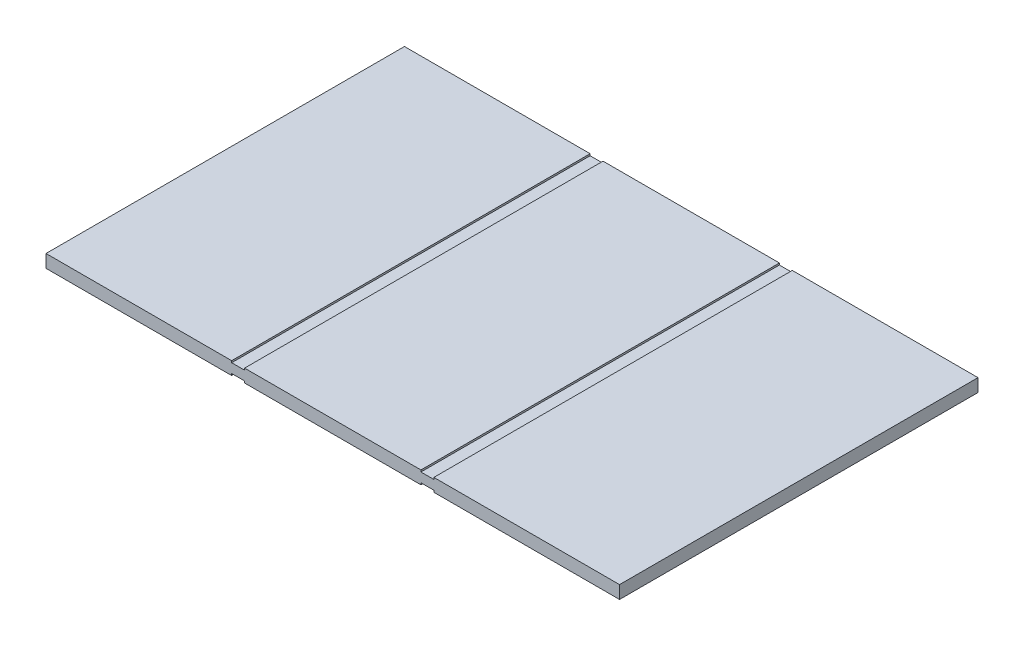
from build123d import *

# Parameters (mm, degrees)
ESBO_O1_W                = 800
ESBO_O1_H                = 500
RESSALTO_EXTRUS_O1_DEPTH = 18
ESBO_O2_W                = 18
ESBO_O2_H                = 500
CORTE_EXTRUS_O1_DEPTH    = 2.5
ESBO_O3_W                = 17.978931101
ESBO_O3_H                = 500
ESBO_O3_W_2              = 18
CORTE_EXTRUS_O2_DEPTH    = 2.5


with BuildPart() as part:
    # Esbo_o1 → Ressalto-extrus_o1 (new body)
    with BuildSketch(Plane(origin=(0, 0, 0), x_dir=(1, 0, 0), z_dir=(0, 1, 0))):
        Rectangle(ESBO_O1_W, ESBO_O1_H)
    extrude(amount=RESSALTO_EXTRUS_O1_DEPTH)

    # Esbo_o2 → Corte-extrus_o1 (cut)
    with BuildSketch(Plane(origin=(0, 18, 0), x_dir=(1, 0, 0), z_dir=(0, 1, 0))):
        with Locations((-132.021068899, 0)):
            Rectangle(ESBO_O2_W, ESBO_O2_H)
        with Locations((131.978931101, 0)):
            Rectangle(ESBO_O2_W, ESBO_O2_H)
    extrude(amount=-CORTE_EXTRUS_O1_DEPTH, mode=Mode.SUBTRACT)

    # Esbo_o3 → Corte-extrus_o2 (cut)
    with BuildSketch(Plane.XZ):
        with Locations((-132.010534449, 0)):
            Rectangle(ESBO_O3_W, ESBO_O3_H)
        with Locations((131.978931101, 0)):
            Rectangle(ESBO_O3_W_2, ESBO_O3_H)
    extrude(amount=-CORTE_EXTRUS_O2_DEPTH, mode=Mode.SUBTRACT)


solid = part.part
